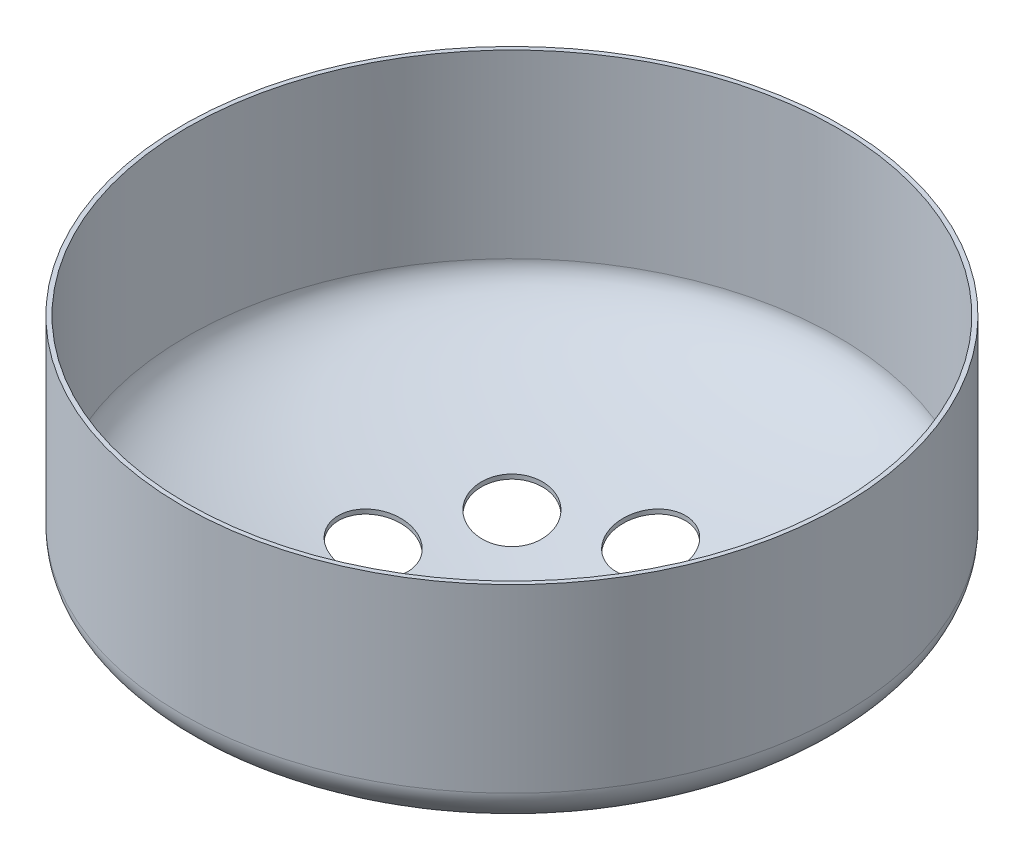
from build123d import *

# Parameters (mm, degrees)
WANDUNG1_T              = -2.5
SKIZZE2_R               = 9.25
LINEAR_AUSTRAGEN1_DEPTH = 316.317300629
SKIZZE3_R               = 20
LINEAR_AUSTRAGEN2_DEPTH = 316.317300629
KREISMUSTER1_COUNT      = 8


with BuildPart() as part:
    # Skizze1 → Rotation1 (revolve)
    with BuildSketch(Plane(origin=(0, 0, 0), x_dir=(0, 0, -1), z_dir=(1, 0, 0)), mode=Mode.PRIVATE) as rotation1_sk:
        with BuildLine():
            Line((190, 165), (0, 165))
            Line((0, 165), (0, 0))
            Line((0, 0), (30, 0))
            add(Edge.make_bspline(
                [(30, 0), (190, 22.232846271), (190, 60.799834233)],
                knots=[5.326795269, 5.326795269, 5.326795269, 6.283185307, 6.283185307, 6.283185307], degree=2, weights=[1, 0.88782698, 1]))
            Line((190, 60.799834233), (190, 165))
        make_face()
    revolve(rotation1_sk.sketch.rotate(Axis((0, 182.531914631, 0), (0, -1, 0)), 180), axis=Axis((0, 182.531914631, 0), (0, -1, 0)))

    # Wandung1
    wandung1_openings = [part.faces().sort_by_distance(p)[0] for p in [
        (0, 165, 0),
    ]]
    offset(amount=WANDUNG1_T, openings=wandung1_openings, kind=Kind.INTERSECTION)

    # Skizze2 → Linear austragen1 (cut, through all)
    with BuildSketch(Plane.XZ):
        with Locations(Location((0, 0, 0), (0, 0, 270))):
            Circle(SKIZZE2_R)
    extrude(amount=-LINEAR_AUSTRAGEN1_DEPTH, mode=Mode.SUBTRACT)

    # Skizze3 → Linear austragen2 (cut, through all)
    with BuildSketch(Plane(origin=(0, 0, 0), x_dir=(1, 0, 0), z_dir=(0, 1, 0))):
        with Locations(Location((80, 0, 0), (0, 0, 90))):
            Circle(SKIZZE3_R)
    linear_austragen2 = extrude(amount=LINEAR_AUSTRAGEN2_DEPTH, mode=Mode.SUBTRACT)

    # Kreismuster1: Linear austragen2 ×8 about axis
    kreismuster1_axis = Axis((0, 0, 0), (0, 1, 0))
    for i in range(1, KREISMUSTER1_COUNT):
        add(linear_austragen2.rotate(kreismuster1_axis, i * 360 / KREISMUSTER1_COUNT), mode=Mode.SUBTRACT)


solid = part.part
